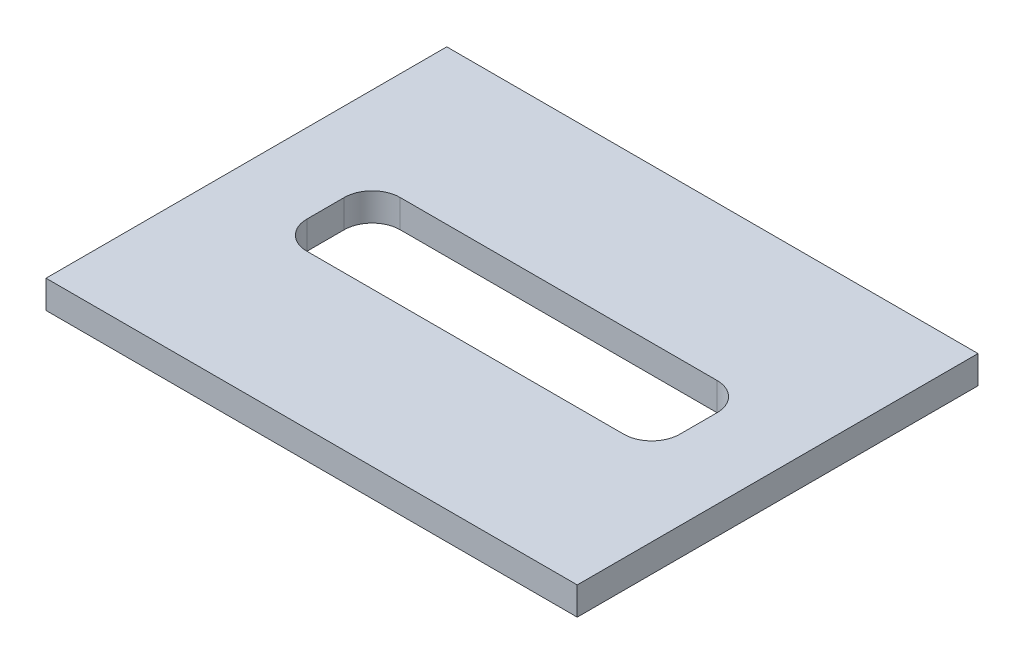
from build123d import *

# Parameters (mm, degrees)
SKETCH1_W           = 57
SKETCH1_H           = 43
BOSS_EXTRUDE1_DEPTH = 3
SKETCH2_W           = 40
SKETCH2_H           = 10
CUT_EXTRUDE1_DEPTH  = 10
FILLET1_R           = 3


with BuildPart() as part:
    # Sketch1 → Boss-Extrude1 (new body)
    with BuildSketch(Plane(origin=(0, 0, 0), x_dir=(1, 0, 0), z_dir=(0, 1, 0))):
        Rectangle(SKETCH1_W, SKETCH1_H)
    extrude(amount=BOSS_EXTRUDE1_DEPTH)

    # Sketch2 → Cut-Extrude1 (cut)
    with BuildSketch(Plane(origin=(0, 3, 0), x_dir=(1, 0, 0), z_dir=(0, 1, 0))):
        Rectangle(SKETCH2_W, SKETCH2_H)
    extrude(amount=-CUT_EXTRUDE1_DEPTH, mode=Mode.SUBTRACT)

    # Fillet1
    fillet1_edges = [part.edges().sort_by_distance(p)[0] for p in [
        (20, 1.5, -5),
        (20, 1.5, 5),
        (-20, 1.5, 5),
        (-20, 1.5, -5),
    ]]
    fillet(fillet1_edges, radius=FILLET1_R)


solid = part.part
